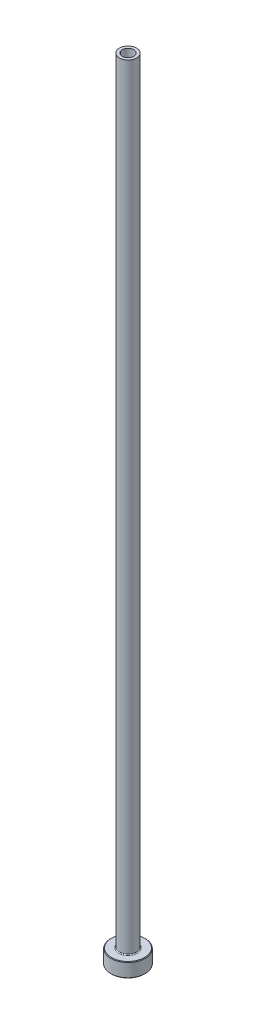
from build123d import *

# Parameters (mm, degrees)
FILLET1_R     = 0.3
CHAMFER1_SIZE = 0.2
CHAMFER3_SIZE = 0.5


with BuildPart() as part:
    # Sketch1 → Revolve1 (revolve)
    with BuildSketch(Plane.XY, mode=Mode.PRIVATE) as revolve1_sk:
        Polygon((-2, 275), (-3, 275), (-3, 5), (-6, 5), (-6, 0), (-2.25, 0), (-2.25, 218), (-2, 230), align=None)
    revolve(revolve1_sk.sketch.rotate(Axis((0, 92.187680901, 0), (0, -1, 0)), 270), axis=Axis((0, 92.187680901, 0), (0, -1, 0)))

    # Fillet1
    fillet1_edges = [part.edges().sort_by_distance(p)[0] for p in [
        (0, 5, -3),
    ]]
    fillet(fillet1_edges, radius=FILLET1_R)

    # Chamfer1
    chamfer1_edges = [part.edges().sort_by_distance(p)[0] for p in [
        (0, 0, -6),
        (0, 5, -6),
    ]]
    chamfer(chamfer1_edges, length=CHAMFER1_SIZE)

    # Chamfer3
    chamfer3_edges = [part.edges().sort_by_distance(p)[0] for p in [
        (0, 0, -2.25),
    ]]
    chamfer(chamfer3_edges, length=CHAMFER3_SIZE)


solid = part.part
